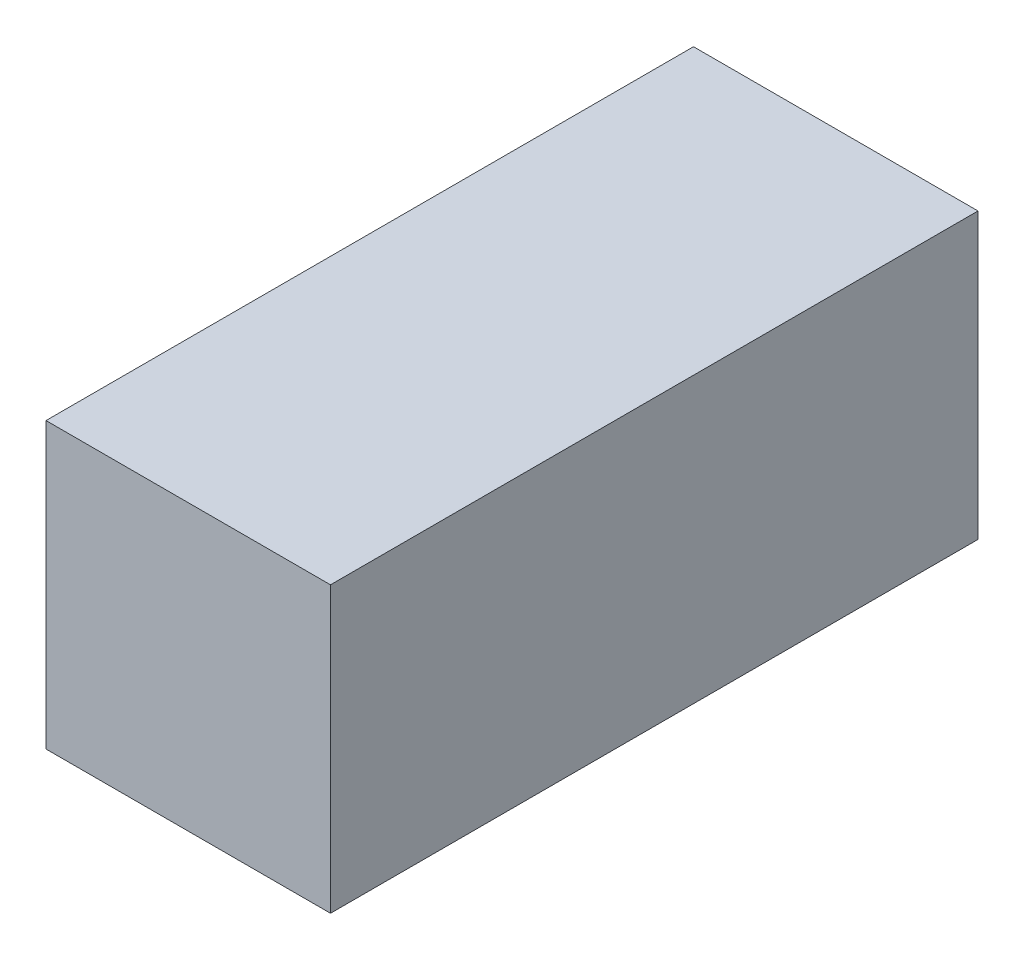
from build123d import *

# Parameters (mm, degrees)
SKETCH1_W           = 34.036
SKETCH1_H           = 34.036
BOSS_EXTRUDE1_DEPTH = 77.47


with BuildPart() as part:
    # Sketch1 → Boss-Extrude1 (new body)
    with BuildSketch(Plane.XY):
        Rectangle(SKETCH1_W, SKETCH1_H)
    extrude(amount=BOSS_EXTRUDE1_DEPTH)


solid = part.part
